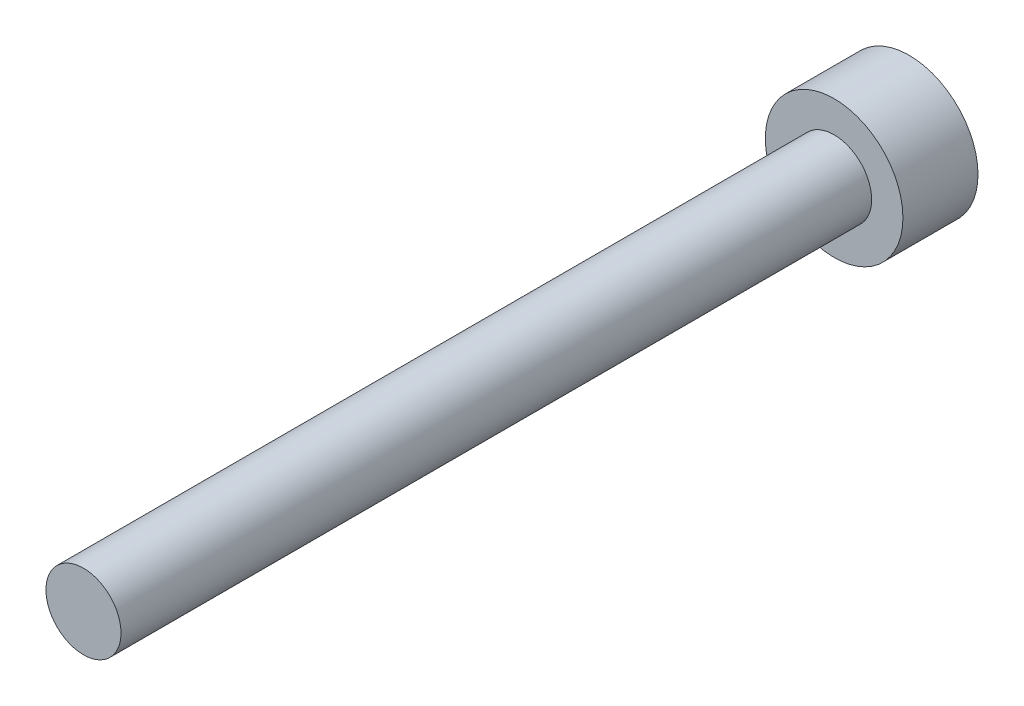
ISO-10303-21;
HEADER;
FILE_DESCRIPTION(('STEP AP214'),'2;1');
FILE_NAME('part.step','',(''),(''),'','','');
FILE_SCHEMA(('AUTOMOTIVE_DESIGN { 1 0 10303 214 1 1 1 1 }'));
ENDSEC;
DATA;
#1=APPLICATION_CONTEXT('core data for automotive mechanical design processes');
#2=APPLICATION_PROTOCOL_DEFINITION('international standard','automotive_design',2000,#1);
#3=PRODUCT_CONTEXT('',#1,'mechanical');
#4=PRODUCT('Part','Part','',(#3));
#5=PRODUCT_RELATED_PRODUCT_CATEGORY('part','',(#4));
#6=PRODUCT_DEFINITION_FORMATION('','',#4);
#7=PRODUCT_DEFINITION_CONTEXT('part definition',#1,'design');
#8=PRODUCT_DEFINITION('design','',#6,#7);
#9=PRODUCT_DEFINITION_SHAPE('','',#8);
#10=(LENGTH_UNIT() NAMED_UNIT(*) SI_UNIT(.MILLI.,.METRE.));
#11=(NAMED_UNIT(*) PLANE_ANGLE_UNIT() SI_UNIT($,.RADIAN.));
#12=(NAMED_UNIT(*) SI_UNIT($,.STERADIAN.) SOLID_ANGLE_UNIT());
#13=UNCERTAINTY_MEASURE_WITH_UNIT(LENGTH_MEASURE(1.E-05),#10,'distance_accuracy_value','');
#14=(GEOMETRIC_REPRESENTATION_CONTEXT(3) GLOBAL_UNCERTAINTY_ASSIGNED_CONTEXT((#13)) GLOBAL_UNIT_ASSIGNED_CONTEXT((#10,
#11,#12)) REPRESENTATION_CONTEXT('',''));
#15=CARTESIAN_POINT('',(0.,0.,0.));
#16=DIRECTION('',(0.,0.,1.));
#17=DIRECTION('',(1.,0.,0.));
#18=AXIS2_PLACEMENT_3D('',#15,#16,#17);
#19=CARTESIAN_POINT('',(0.,0.,0.));
#20=DIRECTION('',(0.,0.,-1.));
#21=DIRECTION('',(-1.,0.,0.));
#22=AXIS2_PLACEMENT_3D('',#19,#20,#21);
#23=CYLINDRICAL_SURFACE('',#22,2.75);
#24=CARTESIAN_POINT('',(0.,0.,0.));
#25=DIRECTION('',(0.,0.,1.));
#26=DIRECTION('',(1.,0.,0.));
#27=AXIS2_PLACEMENT_3D('',#24,#25,#26);
#28=CIRCLE('',#27,2.75);
#29=CARTESIAN_POINT('',(2.75,0.,0.));
#30=VERTEX_POINT('',#29);
#31=EDGE_CURVE('E48',#30,#30,#28,.T.);
#32=ORIENTED_EDGE('',*,*,#31,.F.);
#33=EDGE_LOOP('',(#32));
#34=FACE_BOUND('',#33,.T.);
#35=CARTESIAN_POINT('',(0.,0.,-3.));
#36=DIRECTION('',(0.,0.,1.));
#37=DIRECTION('',(1.,0.,0.));
#38=AXIS2_PLACEMENT_3D('',#35,#36,#37);
#39=CIRCLE('',#38,2.75);
#40=CARTESIAN_POINT('',(2.75,0.,-3.));
#41=VERTEX_POINT('',#40);
#42=EDGE_CURVE('E44',#41,#41,#39,.T.);
#43=ORIENTED_EDGE('',*,*,#42,.T.);
#44=EDGE_LOOP('',(#43));
#45=FACE_BOUND('',#44,.T.);
#46=ADVANCED_FACE('F41',(#34,#45),#23,.T.);
#47=CARTESIAN_POINT('',(0.,0.,0.));
#48=DIRECTION('',(0.,0.,1.));
#49=DIRECTION('',(1.,0.,0.));
#50=AXIS2_PLACEMENT_3D('',#47,#48,#49);
#51=PLANE('',#50);
#52=CARTESIAN_POINT('',(0.,0.,0.));
#53=DIRECTION('',(0.,0.,1.));
#54=DIRECTION('',(1.,0.,0.));
#55=AXIS2_PLACEMENT_3D('',#52,#53,#54);
#56=CIRCLE('',#55,1.5);
#57=CARTESIAN_POINT('',(1.5,0.,0.));
#58=VERTEX_POINT('',#57);
#59=EDGE_CURVE('E10',#58,#58,#56,.T.);
#60=ORIENTED_EDGE('',*,*,#59,.F.);
#61=EDGE_LOOP('',(#60));
#62=FACE_BOUND('',#61,.T.);
#63=ORIENTED_EDGE('',*,*,#31,.T.);
#64=EDGE_LOOP('',(#63));
#65=FACE_BOUND('',#64,.T.);
#66=ADVANCED_FACE('F65',(#62,#65),#51,.T.);
#67=CARTESIAN_POINT('',(0.,0.,-3.));
#68=DIRECTION('',(0.,0.,1.));
#69=DIRECTION('',(1.,0.,0.));
#70=AXIS2_PLACEMENT_3D('',#67,#68,#69);
#71=PLANE('',#70);
#72=ORIENTED_EDGE('',*,*,#42,.F.);
#73=EDGE_LOOP('',(#72));
#74=FACE_BOUND('',#73,.T.);
#75=ADVANCED_FACE('F62',(#74),#71,.F.);
#76=CARTESIAN_POINT('',(0.,0.,30.));
#77=DIRECTION('',(0.,0.,-1.));
#78=DIRECTION('',(-1.,0.,0.));
#79=AXIS2_PLACEMENT_3D('',#76,#77,#78);
#80=CYLINDRICAL_SURFACE('',#79,1.5);
#81=CARTESIAN_POINT('',(0.,0.,30.));
#82=DIRECTION('',(0.,0.,1.));
#83=DIRECTION('',(1.,0.,0.));
#84=AXIS2_PLACEMENT_3D('',#81,#82,#83);
#85=CIRCLE('',#84,1.5);
#86=CARTESIAN_POINT('',(1.5,0.,30.));
#87=VERTEX_POINT('',#86);
#88=EDGE_CURVE('E54',#87,#87,#85,.T.);
#89=ORIENTED_EDGE('',*,*,#88,.F.);
#90=EDGE_LOOP('',(#89));
#91=FACE_BOUND('',#90,.T.);
#92=ORIENTED_EDGE('',*,*,#59,.T.);
#93=EDGE_LOOP('',(#92));
#94=FACE_BOUND('',#93,.T.);
#95=ADVANCED_FACE('F64',(#91,#94),#80,.T.);
#96=CARTESIAN_POINT('',(0.,0.,30.));
#97=DIRECTION('',(0.,0.,1.));
#98=DIRECTION('',(1.,0.,0.));
#99=AXIS2_PLACEMENT_3D('',#96,#97,#98);
#100=PLANE('',#99);
#101=ORIENTED_EDGE('',*,*,#88,.T.);
#102=EDGE_LOOP('',(#101));
#103=FACE_BOUND('',#102,.T.);
#104=ADVANCED_FACE('F71',(#103),#100,.T.);
#105=CLOSED_SHELL('',(#46,#66,#75,#95,#104));
#106=MANIFOLD_SOLID_BREP('B2',#105);
#107=ADVANCED_BREP_SHAPE_REPRESENTATION('',(#18,#106),#14);
#108=SHAPE_DEFINITION_REPRESENTATION(#9,#107);
ENDSEC;
END-ISO-10303-21;
